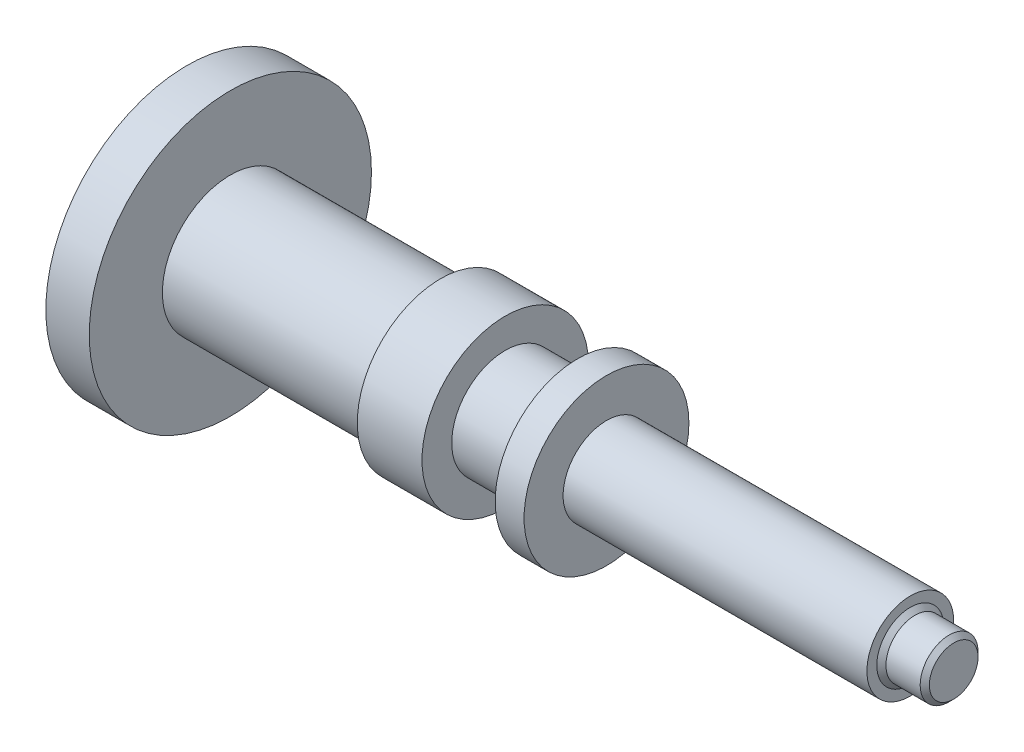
ISO-10303-21;
HEADER;
FILE_DESCRIPTION(('STEP AP214'),'2;1');
FILE_NAME('part.step','',(''),(''),'','','');
FILE_SCHEMA(('AUTOMOTIVE_DESIGN { 1 0 10303 214 1 1 1 1 }'));
ENDSEC;
DATA;
#1=APPLICATION_CONTEXT('core data for automotive mechanical design processes');
#2=APPLICATION_PROTOCOL_DEFINITION('international standard','automotive_design',2000,#1);
#3=PRODUCT_CONTEXT('',#1,'mechanical');
#4=PRODUCT('Part','Part','',(#3));
#5=PRODUCT_RELATED_PRODUCT_CATEGORY('part','',(#4));
#6=PRODUCT_DEFINITION_FORMATION('','',#4);
#7=PRODUCT_DEFINITION_CONTEXT('part definition',#1,'design');
#8=PRODUCT_DEFINITION('design','',#6,#7);
#9=PRODUCT_DEFINITION_SHAPE('','',#8);
#10=(LENGTH_UNIT() NAMED_UNIT(*) SI_UNIT(.MILLI.,.METRE.));
#11=(NAMED_UNIT(*) PLANE_ANGLE_UNIT() SI_UNIT($,.RADIAN.));
#12=(NAMED_UNIT(*) SI_UNIT($,.STERADIAN.) SOLID_ANGLE_UNIT());
#13=UNCERTAINTY_MEASURE_WITH_UNIT(LENGTH_MEASURE(1.E-05),#10,'distance_accuracy_value','');
#14=(GEOMETRIC_REPRESENTATION_CONTEXT(3) GLOBAL_UNCERTAINTY_ASSIGNED_CONTEXT((#13)) GLOBAL_UNIT_ASSIGNED_CONTEXT((#10,
#11,#12)) REPRESENTATION_CONTEXT('',''));
#15=CARTESIAN_POINT('',(0.,0.,0.));
#16=DIRECTION('',(0.,0.,1.));
#17=DIRECTION('',(1.,0.,0.));
#18=AXIS2_PLACEMENT_3D('',#15,#16,#17);
#19=CARTESIAN_POINT('',(-275.,0.,0.));
#20=DIRECTION('',(1.,0.,0.));
#21=DIRECTION('',(0.,0.,-1.));
#22=AXIS2_PLACEMENT_3D('',#19,#20,#21);
#23=PLANE('',#22);
#24=CARTESIAN_POINT('',(-275.,0.,0.));
#25=DIRECTION('',(1.,0.,0.));
#26=DIRECTION('',(0.,0.,-1.));
#27=AXIS2_PLACEMENT_3D('',#24,#25,#26);
#28=CIRCLE('',#27,27.1835283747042);
#29=CARTESIAN_POINT('',(-275.,0.,-27.1835283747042));
#30=VERTEX_POINT('',#29);
#31=EDGE_CURVE('E10',#30,#30,#28,.F.);
#32=ORIENTED_EDGE('',*,*,#31,.T.);
#33=EDGE_LOOP('',(#32));
#34=FACE_BOUND('',#33,.T.);
#35=ADVANCED_FACE('F26',(#34),#23,.F.);
#36=CARTESIAN_POINT('',(0.,0.,0.));
#37=DIRECTION('',(1.,0.,0.));
#38=DIRECTION('',(0.,0.,-1.));
#39=AXIS2_PLACEMENT_3D('',#36,#37,#38);
#40=CYLINDRICAL_SURFACE('',#39,28.7710283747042);
#41=CARTESIAN_POINT('',(-273.4125,0.,0.));
#42=DIRECTION('',(1.,0.,0.));
#43=DIRECTION('',(0.,0.,-1.));
#44=AXIS2_PLACEMENT_3D('',#41,#42,#43);
#45=CIRCLE('',#44,28.7710283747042);
#46=CARTESIAN_POINT('',(-273.4125,0.,-28.7710283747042));
#47=VERTEX_POINT('',#46);
#48=EDGE_CURVE('E32',#47,#47,#45,.T.);
#49=ORIENTED_EDGE('',*,*,#48,.T.);
#50=EDGE_LOOP('',(#49));
#51=FACE_BOUND('',#50,.T.);
#52=CARTESIAN_POINT('',(-265.,0.,0.));
#53=DIRECTION('',(1.,0.,0.));
#54=DIRECTION('',(0.,0.,-1.));
#55=AXIS2_PLACEMENT_3D('',#52,#53,#54);
#56=CIRCLE('',#55,28.7710283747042);
#57=CARTESIAN_POINT('',(-265.,0.,-28.7710283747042));
#58=VERTEX_POINT('',#57);
#59=EDGE_CURVE('E51',#58,#58,#56,.T.);
#60=ORIENTED_EDGE('',*,*,#59,.F.);
#61=EDGE_LOOP('',(#60));
#62=FACE_BOUND('',#61,.T.);
#63=ADVANCED_FACE('F162',(#51,#62),#40,.T.);
#64=CARTESIAN_POINT('',(-265.,28.7710283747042,0.));
#65=DIRECTION('',(1.,0.,0.));
#66=DIRECTION('',(0.,0.,-1.));
#67=AXIS2_PLACEMENT_3D('',#64,#65,#66);
#68=PLANE('',#67);
#69=CARTESIAN_POINT('',(-265.,0.,0.));
#70=DIRECTION('',(1.,0.,0.));
#71=DIRECTION('',(0.,0.,-1.));
#72=AXIS2_PLACEMENT_3D('',#69,#70,#71);
#73=CIRCLE('',#72,48.7710283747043);
#74=CARTESIAN_POINT('',(-265.,0.,-48.7710283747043));
#75=VERTEX_POINT('',#74);
#76=EDGE_CURVE('E54',#75,#75,#73,.T.);
#77=ORIENTED_EDGE('',*,*,#76,.F.);
#78=EDGE_LOOP('',(#77));
#79=FACE_BOUND('',#78,.T.);
#80=ORIENTED_EDGE('',*,*,#59,.T.);
#81=EDGE_LOOP('',(#80));
#82=FACE_BOUND('',#81,.T.);
#83=ADVANCED_FACE('F156',(#79,#82),#68,.F.);
#84=CARTESIAN_POINT('',(0.,0.,0.));
#85=DIRECTION('',(1.,0.,0.));
#86=DIRECTION('',(0.,0.,-1.));
#87=AXIS2_PLACEMENT_3D('',#84,#85,#86);
#88=CYLINDRICAL_SURFACE('',#87,48.7710283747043);
#89=CARTESIAN_POINT('',(-250.,0.,0.));
#90=DIRECTION('',(1.,0.,0.));
#91=DIRECTION('',(0.,0.,-1.));
#92=AXIS2_PLACEMENT_3D('',#89,#90,#91);
#93=CIRCLE('',#92,48.7710283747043);
#94=CARTESIAN_POINT('',(-250.,0.,-48.7710283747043));
#95=VERTEX_POINT('',#94);
#96=EDGE_CURVE('E57',#95,#95,#93,.T.);
#97=ORIENTED_EDGE('',*,*,#96,.F.);
#98=EDGE_LOOP('',(#97));
#99=FACE_BOUND('',#98,.T.);
#100=ORIENTED_EDGE('',*,*,#76,.T.);
#101=EDGE_LOOP('',(#100));
#102=FACE_BOUND('',#101,.T.);
#103=ADVANCED_FACE('F150',(#99,#102),#88,.T.);
#104=CARTESIAN_POINT('',(-250.,48.7710283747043,0.));
#105=DIRECTION('',(-1.,0.,0.));
#106=DIRECTION('',(0.,0.,1.));
#107=AXIS2_PLACEMENT_3D('',#104,#105,#106);
#108=PLANE('',#107);
#109=CARTESIAN_POINT('',(-250.,0.,0.));
#110=DIRECTION('',(1.,0.,0.));
#111=DIRECTION('',(0.,0.,-1.));
#112=AXIS2_PLACEMENT_3D('',#109,#110,#111);
#113=CIRCLE('',#112,23.4911735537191);
#114=CARTESIAN_POINT('',(-250.,0.,-23.4911735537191));
#115=VERTEX_POINT('',#114);
#116=EDGE_CURVE('E60',#115,#115,#113,.T.);
#117=ORIENTED_EDGE('',*,*,#116,.F.);
#118=EDGE_LOOP('',(#117));
#119=FACE_BOUND('',#118,.T.);
#120=ORIENTED_EDGE('',*,*,#96,.T.);
#121=EDGE_LOOP('',(#120));
#122=FACE_BOUND('',#121,.T.);
#123=ADVANCED_FACE('F144',(#119,#122),#108,.F.);
#124=CARTESIAN_POINT('',(0.,0.,0.));
#125=DIRECTION('',(1.,0.,0.));
#126=DIRECTION('',(0.,0.,-1.));
#127=AXIS2_PLACEMENT_3D('',#124,#125,#126);
#128=CYLINDRICAL_SURFACE('',#127,23.4911735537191);
#129=CARTESIAN_POINT('',(-180.,0.,0.));
#130=DIRECTION('',(1.,0.,0.));
#131=DIRECTION('',(0.,0.,-1.));
#132=AXIS2_PLACEMENT_3D('',#129,#130,#131);
#133=CIRCLE('',#132,23.4911735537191);
#134=CARTESIAN_POINT('',(-180.,0.,-23.4911735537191));
#135=VERTEX_POINT('',#134);
#136=EDGE_CURVE('E63',#135,#135,#133,.T.);
#137=ORIENTED_EDGE('',*,*,#136,.F.);
#138=EDGE_LOOP('',(#137));
#139=FACE_BOUND('',#138,.T.);
#140=ORIENTED_EDGE('',*,*,#116,.T.);
#141=EDGE_LOOP('',(#140));
#142=FACE_BOUND('',#141,.T.);
#143=ADVANCED_FACE('F138',(#139,#142),#128,.T.);
#144=CARTESIAN_POINT('',(-180.,0.,0.));
#145=DIRECTION('',(1.,0.,0.));
#146=DIRECTION('',(0.,0.,-1.));
#147=AXIS2_PLACEMENT_3D('',#144,#145,#146);
#148=CONICAL_SURFACE('',#147,23.4911735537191,1.10714871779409);
#149=CARTESIAN_POINT('',(-177.360072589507,0.,0.));
#150=DIRECTION('',(1.,0.,0.));
#151=DIRECTION('',(0.,0.,-1.));
#152=AXIS2_PLACEMENT_3D('',#149,#150,#151);
#153=CIRCLE('',#152,28.7710283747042);
#154=CARTESIAN_POINT('',(-177.360072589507,0.,-28.7710283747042));
#155=VERTEX_POINT('',#154);
#156=EDGE_CURVE('E66',#155,#155,#153,.T.);
#157=ORIENTED_EDGE('',*,*,#156,.F.);
#158=EDGE_LOOP('',(#157));
#159=FACE_BOUND('',#158,.T.);
#160=ORIENTED_EDGE('',*,*,#136,.T.);
#161=EDGE_LOOP('',(#160));
#162=FACE_BOUND('',#161,.T.);
#163=ADVANCED_FACE('F132',(#159,#162),#148,.T.);
#164=CARTESIAN_POINT('',(0.,0.,0.));
#165=DIRECTION('',(1.,0.,0.));
#166=DIRECTION('',(0.,0.,-1.));
#167=AXIS2_PLACEMENT_3D('',#164,#165,#166);
#168=CYLINDRICAL_SURFACE('',#167,28.7710283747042);
#169=CARTESIAN_POINT('',(-155.,0.,0.));
#170=DIRECTION('',(1.,0.,0.));
#171=DIRECTION('',(0.,0.,-1.));
#172=AXIS2_PLACEMENT_3D('',#169,#170,#171);
#173=CIRCLE('',#172,28.7710283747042);
#174=CARTESIAN_POINT('',(-155.,0.,-28.7710283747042));
#175=VERTEX_POINT('',#174);
#176=EDGE_CURVE('E69',#175,#175,#173,.T.);
#177=ORIENTED_EDGE('',*,*,#176,.F.);
#178=EDGE_LOOP('',(#177));
#179=FACE_BOUND('',#178,.T.);
#180=ORIENTED_EDGE('',*,*,#156,.T.);
#181=EDGE_LOOP('',(#180));
#182=FACE_BOUND('',#181,.T.);
#183=ADVANCED_FACE('F126',(#179,#182),#168,.T.);
#184=CARTESIAN_POINT('',(-155.,28.7710283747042,0.));
#185=DIRECTION('',(-1.,0.,0.));
#186=DIRECTION('',(0.,0.,1.));
#187=AXIS2_PLACEMENT_3D('',#184,#185,#186);
#188=PLANE('',#187);
#189=CARTESIAN_POINT('',(-155.,0.,0.));
#190=DIRECTION('',(1.,0.,0.));
#191=DIRECTION('',(0.,0.,-1.));
#192=AXIS2_PLACEMENT_3D('',#189,#190,#191);
#193=CIRCLE('',#192,18.4911735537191);
#194=CARTESIAN_POINT('',(-155.,0.,-18.4911735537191));
#195=VERTEX_POINT('',#194);
#196=EDGE_CURVE('E72',#195,#195,#193,.T.);
#197=ORIENTED_EDGE('',*,*,#196,.F.);
#198=EDGE_LOOP('',(#197));
#199=FACE_BOUND('',#198,.T.);
#200=ORIENTED_EDGE('',*,*,#176,.T.);
#201=EDGE_LOOP('',(#200));
#202=FACE_BOUND('',#201,.T.);
#203=ADVANCED_FACE('F120',(#199,#202),#188,.F.);
#204=CARTESIAN_POINT('',(0.,0.,0.));
#205=DIRECTION('',(1.,0.,0.));
#206=DIRECTION('',(0.,0.,-1.));
#207=AXIS2_PLACEMENT_3D('',#204,#205,#206);
#208=CYLINDRICAL_SURFACE('',#207,18.4911735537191);
#209=CARTESIAN_POINT('',(-130.,0.,0.));
#210=DIRECTION('',(1.,0.,0.));
#211=DIRECTION('',(0.,0.,-1.));
#212=AXIS2_PLACEMENT_3D('',#209,#210,#211);
#213=CIRCLE('',#212,18.4911735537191);
#214=CARTESIAN_POINT('',(-130.,0.,-18.4911735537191));
#215=VERTEX_POINT('',#214);
#216=EDGE_CURVE('E75',#215,#215,#213,.T.);
#217=ORIENTED_EDGE('',*,*,#216,.F.);
#218=EDGE_LOOP('',(#217));
#219=FACE_BOUND('',#218,.T.);
#220=ORIENTED_EDGE('',*,*,#196,.T.);
#221=EDGE_LOOP('',(#220));
#222=FACE_BOUND('',#221,.T.);
#223=ADVANCED_FACE('F114',(#219,#222),#208,.T.);
#224=CARTESIAN_POINT('',(-130.,18.4911735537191,0.));
#225=DIRECTION('',(1.,0.,0.));
#226=DIRECTION('',(0.,0.,-1.));
#227=AXIS2_PLACEMENT_3D('',#224,#225,#226);
#228=PLANE('',#227);
#229=CARTESIAN_POINT('',(-130.,0.,0.));
#230=DIRECTION('',(1.,0.,0.));
#231=DIRECTION('',(0.,0.,-1.));
#232=AXIS2_PLACEMENT_3D('',#229,#230,#231);
#233=CIRCLE('',#232,28.4911735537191);
#234=CARTESIAN_POINT('',(-130.,0.,-28.4911735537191));
#235=VERTEX_POINT('',#234);
#236=EDGE_CURVE('E78',#235,#235,#233,.T.);
#237=ORIENTED_EDGE('',*,*,#236,.F.);
#238=EDGE_LOOP('',(#237));
#239=FACE_BOUND('',#238,.T.);
#240=ORIENTED_EDGE('',*,*,#216,.T.);
#241=EDGE_LOOP('',(#240));
#242=FACE_BOUND('',#241,.T.);
#243=ADVANCED_FACE('F108',(#239,#242),#228,.F.);
#244=CARTESIAN_POINT('',(0.,0.,0.));
#245=DIRECTION('',(1.,0.,0.));
#246=DIRECTION('',(0.,0.,-1.));
#247=AXIS2_PLACEMENT_3D('',#244,#245,#246);
#248=CYLINDRICAL_SURFACE('',#247,28.4911735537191);
#249=CARTESIAN_POINT('',(-120.,0.,0.));
#250=DIRECTION('',(1.,0.,0.));
#251=DIRECTION('',(0.,0.,-1.));
#252=AXIS2_PLACEMENT_3D('',#249,#250,#251);
#253=CIRCLE('',#252,28.4911735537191);
#254=CARTESIAN_POINT('',(-120.,0.,-28.4911735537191));
#255=VERTEX_POINT('',#254);
#256=EDGE_CURVE('E81',#255,#255,#253,.T.);
#257=ORIENTED_EDGE('',*,*,#256,.F.);
#258=EDGE_LOOP('',(#257));
#259=FACE_BOUND('',#258,.T.);
#260=ORIENTED_EDGE('',*,*,#236,.T.);
#261=EDGE_LOOP('',(#260));
#262=FACE_BOUND('',#261,.T.);
#263=ADVANCED_FACE('F102',(#259,#262),#248,.T.);
#264=CARTESIAN_POINT('',(-120.,28.4911735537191,0.));
#265=DIRECTION('',(-1.,0.,0.));
#266=DIRECTION('',(0.,0.,1.));
#267=AXIS2_PLACEMENT_3D('',#264,#265,#266);
#268=PLANE('',#267);
#269=CARTESIAN_POINT('',(-120.,0.,0.));
#270=DIRECTION('',(1.,0.,0.));
#271=DIRECTION('',(0.,0.,-1.));
#272=AXIS2_PLACEMENT_3D('',#269,#270,#271);
#273=CIRCLE('',#272,15.);
#274=CARTESIAN_POINT('',(-120.,0.,-15.));
#275=VERTEX_POINT('',#274);
#276=EDGE_CURVE('E84',#275,#275,#273,.T.);
#277=ORIENTED_EDGE('',*,*,#276,.F.);
#278=EDGE_LOOP('',(#277));
#279=FACE_BOUND('',#278,.T.);
#280=ORIENTED_EDGE('',*,*,#256,.T.);
#281=EDGE_LOOP('',(#280));
#282=FACE_BOUND('',#281,.T.);
#283=ADVANCED_FACE('F96',(#279,#282),#268,.F.);
#284=CARTESIAN_POINT('',(0.,0.,0.));
#285=DIRECTION('',(1.,0.,0.));
#286=DIRECTION('',(0.,0.,-1.));
#287=AXIS2_PLACEMENT_3D('',#284,#285,#286);
#288=CYLINDRICAL_SURFACE('',#287,15.);
#289=CARTESIAN_POINT('',(-15.,0.,0.));
#290=DIRECTION('',(1.,0.,0.));
#291=DIRECTION('',(0.,0.,-1.));
#292=AXIS2_PLACEMENT_3D('',#289,#290,#291);
#293=CIRCLE('',#292,15.);
#294=CARTESIAN_POINT('',(-15.,0.,-15.));
#295=VERTEX_POINT('',#294);
#296=EDGE_CURVE('E87',#295,#295,#293,.T.);
#297=ORIENTED_EDGE('',*,*,#296,.F.);
#298=EDGE_LOOP('',(#297));
#299=FACE_BOUND('',#298,.T.);
#300=ORIENTED_EDGE('',*,*,#276,.T.);
#301=EDGE_LOOP('',(#300));
#302=FACE_BOUND('',#301,.T.);
#303=ADVANCED_FACE('F93',(#299,#302),#288,.T.);
#304=CARTESIAN_POINT('',(-15.,15.,0.));
#305=DIRECTION('',(-1.,0.,0.));
#306=DIRECTION('',(0.,0.,1.));
#307=AXIS2_PLACEMENT_3D('',#304,#305,#306);
#308=PLANE('',#307);
#309=CARTESIAN_POINT('',(-15.,0.,0.));
#310=DIRECTION('',(-1.,0.,0.));
#311=DIRECTION('',(0.,0.,1.));
#312=AXIS2_PLACEMENT_3D('',#309,#310,#311);
#313=CIRCLE('',#312,11.5875);
#314=CARTESIAN_POINT('',(-15.,0.,11.5875));
#315=VERTEX_POINT('',#314);
#316=EDGE_CURVE('E36',#315,#315,#313,.T.);
#317=ORIENTED_EDGE('',*,*,#316,.T.);
#318=EDGE_LOOP('',(#317));
#319=FACE_BOUND('',#318,.T.);
#320=ORIENTED_EDGE('',*,*,#296,.T.);
#321=EDGE_LOOP('',(#320));
#322=FACE_BOUND('',#321,.T.);
#323=ADVANCED_FACE('F91',(#319,#322),#308,.F.);
#324=CARTESIAN_POINT('',(0.,0.,0.));
#325=DIRECTION('',(1.,0.,0.));
#326=DIRECTION('',(0.,0.,-1.));
#327=AXIS2_PLACEMENT_3D('',#324,#325,#326);
#328=CYLINDRICAL_SURFACE('',#327,10.);
#329=CARTESIAN_POINT('',(-1.5875,0.,0.));
#330=DIRECTION('',(-1.,0.,0.));
#331=DIRECTION('',(0.,0.,1.));
#332=AXIS2_PLACEMENT_3D('',#329,#330,#331);
#333=CIRCLE('',#332,10.);
#334=CARTESIAN_POINT('',(-1.5875,0.,10.));
#335=VERTEX_POINT('',#334);
#336=EDGE_CURVE('E40',#335,#335,#333,.T.);
#337=ORIENTED_EDGE('',*,*,#336,.T.);
#338=EDGE_LOOP('',(#337));
#339=FACE_BOUND('',#338,.T.);
#340=CARTESIAN_POINT('',(-13.4125,0.,0.));
#341=DIRECTION('',(-1.,0.,0.));
#342=DIRECTION('',(0.,0.,1.));
#343=AXIS2_PLACEMENT_3D('',#340,#341,#342);
#344=CIRCLE('',#343,10.);
#345=CARTESIAN_POINT('',(-13.4125,0.,10.));
#346=VERTEX_POINT('',#345);
#347=EDGE_CURVE('E45',#346,#346,#344,.F.);
#348=ORIENTED_EDGE('',*,*,#347,.T.);
#349=EDGE_LOOP('',(#348));
#350=FACE_BOUND('',#349,.T.);
#351=ADVANCED_FACE('F173',(#339,#350),#328,.T.);
#352=CARTESIAN_POINT('',(0.,10.,0.));
#353=DIRECTION('',(-1.,0.,0.));
#354=DIRECTION('',(0.,0.,1.));
#355=AXIS2_PLACEMENT_3D('',#352,#353,#354);
#356=PLANE('',#355);
#357=CARTESIAN_POINT('',(0.,0.,0.));
#358=DIRECTION('',(-1.,0.,0.));
#359=DIRECTION('',(0.,0.,1.));
#360=AXIS2_PLACEMENT_3D('',#357,#358,#359);
#361=CIRCLE('',#360,8.4125);
#362=CARTESIAN_POINT('',(0.,0.,8.4125));
#363=VERTEX_POINT('',#362);
#364=EDGE_CURVE('E48',#363,#363,#361,.F.);
#365=ORIENTED_EDGE('',*,*,#364,.T.);
#366=EDGE_LOOP('',(#365));
#367=FACE_BOUND('',#366,.T.);
#368=ADVANCED_FACE('F177',(#367),#356,.F.);
#369=CARTESIAN_POINT('',(0.,0.,0.));
#370=DIRECTION('',(-1.,0.,0.));
#371=DIRECTION('',(0.,0.,1.));
#372=AXIS2_PLACEMENT_3D('',#369,#370,#371);
#373=CONICAL_SURFACE('',#372,8.4125,0.785398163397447);
#374=ORIENTED_EDGE('',*,*,#336,.F.);
#375=EDGE_LOOP('',(#374));
#376=FACE_BOUND('',#375,.T.);
#377=ORIENTED_EDGE('',*,*,#364,.F.);
#378=EDGE_LOOP('',(#377));
#379=FACE_BOUND('',#378,.T.);
#380=ADVANCED_FACE('F181',(#376,#379),#373,.T.);
#381=CARTESIAN_POINT('',(-13.4125,0.,0.));
#382=DIRECTION('',(-1.,0.,0.));
#383=DIRECTION('',(0.,0.,1.));
#384=AXIS2_PLACEMENT_3D('',#381,#382,#383);
#385=CONICAL_SURFACE('',#384,10.,0.785398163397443);
#386=ORIENTED_EDGE('',*,*,#316,.F.);
#387=EDGE_LOOP('',(#386));
#388=FACE_BOUND('',#387,.T.);
#389=ORIENTED_EDGE('',*,*,#347,.F.);
#390=EDGE_LOOP('',(#389));
#391=FACE_BOUND('',#390,.T.);
#392=ADVANCED_FACE('F185',(#388,#391),#385,.T.);
#393=CARTESIAN_POINT('',(-273.4125,0.,0.));
#394=DIRECTION('',(1.,0.,0.));
#395=DIRECTION('',(0.,0.,-1.));
#396=AXIS2_PLACEMENT_3D('',#393,#394,#395);
#397=CONICAL_SURFACE('',#396,28.7710283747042,0.785398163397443);
#398=ORIENTED_EDGE('',*,*,#31,.F.);
#399=EDGE_LOOP('',(#398));
#400=FACE_BOUND('',#399,.T.);
#401=ORIENTED_EDGE('',*,*,#48,.F.);
#402=EDGE_LOOP('',(#401));
#403=FACE_BOUND('',#402,.T.);
#404=ADVANCED_FACE('F189',(#400,#403),#397,.T.);
#405=CLOSED_SHELL('',(#35,#63,#83,#103,#123,#143,#163,#183,#203,#223,#243,#263,#283,#303,#323,
#351,#368,#380,#392,#404));
#406=MANIFOLD_SOLID_BREP('B2',#405);
#407=ADVANCED_BREP_SHAPE_REPRESENTATION('',(#18,#406),#14);
#408=SHAPE_DEFINITION_REPRESENTATION(#9,#407);
ENDSEC;
END-ISO-10303-21;
